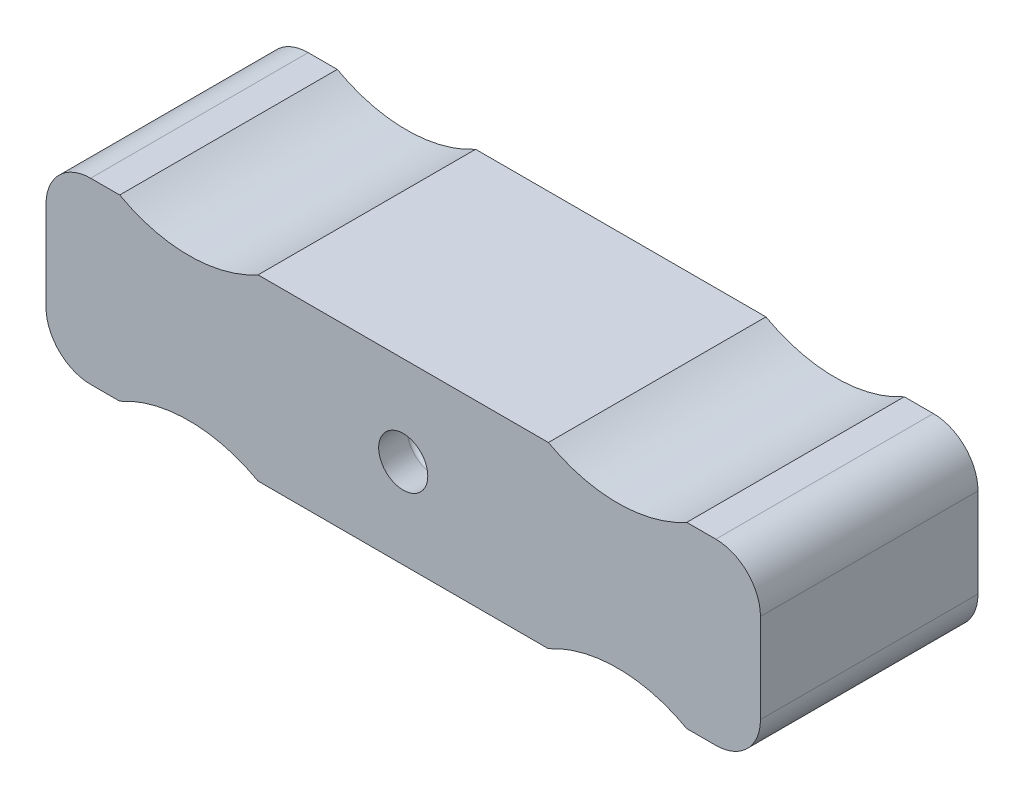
from build123d import *

# Parameters (mm, degrees)
ESQUISSE2_R                     = 2.5
EXTRUSION1_DEPTH                = 24.36
TROU_TARAUD_M6X1_01_D           = 5
TROU_TARAUD_M6X1_01_DEPTH       = 18
TROU_TARAUD_M6X1_01_CBORE_D     = 6
TROU_TARAUD_M6X1_01_CBORE_DEPTH = 15
TROU_TARAUD_M6X1_01_TIP         = 1.502151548


with BuildPart() as part:
    # Esquisse2 → Extrusion1 (new body)
    with BuildSketch(Plane.XY.offset(-20)):
        with BuildLine():
            Line((63, 95), (66.254033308, 95))
            ThreePointArc((66.254033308, 95), (74, 97), (81.745966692, 95))
            Line((81.745966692, 95), (114.254033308, 95))
            ThreePointArc((114.254033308, 95), (122, 97), (129.745966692, 95))
            Line((129.745966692, 95), (133, 95))
            ThreePointArc((133, 95), (136.535533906, 96.464466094), (138, 100))
            Line((138, 100), (138, 110))
            ThreePointArc((138, 110), (136.535533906, 113.535533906), (133, 115))
            Line((133, 115), (129.745966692, 115))
            ThreePointArc((129.745966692, 115), (122, 113), (114.254033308, 115))
            Line((114.254033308, 115), (81.745966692, 115))
            ThreePointArc((81.745966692, 115), (74, 113), (66.254033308, 115))
            Line((66.254033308, 115), (63, 115))
            ThreePointArc((63, 115), (59.464466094, 113.535533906), (58, 110))
            Line((58, 110), (58, 100))
            ThreePointArc((58, 100), (59.464466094, 96.464466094), (63, 95))
        make_face()
        with Locations((98, 105)):
            Circle(ESQUISSE2_R, mode=Mode.SUBTRACT)
    extrude(amount=EXTRUSION1_DEPTH)

    # Trou taraud_ M6x1.01
    with Locations(Plane(origin=(0, 0, -20), x_dir=(-1, 0, 0), z_dir=(0, 0, -1))):
        with Locations((-85.5, 105), (-110.5, 105)):
            CounterBoreHole(TROU_TARAUD_M6X1_01_D / 2, TROU_TARAUD_M6X1_01_CBORE_D / 2, TROU_TARAUD_M6X1_01_CBORE_DEPTH, depth=TROU_TARAUD_M6X1_01_DEPTH)
            with Locations((0, 0, -(TROU_TARAUD_M6X1_01_DEPTH + TROU_TARAUD_M6X1_01_TIP / 2))):  # 118° drill point
                Cone(0, TROU_TARAUD_M6X1_01_D / 2, TROU_TARAUD_M6X1_01_TIP, mode=Mode.SUBTRACT)

    # Esquisse7 → Enl_vement de mati_re-R_volution1 (revolve, cut)
    with BuildSketch(Plane(origin=(0, 105, 0), x_dir=(-1, 0, 0), z_dir=(0, 1, 0))):
        with BuildLine():
            Line((-98, 4.36), (-100.75, 4.36))
            Line((-100.75, 4.36), (-101.052397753, 0.903577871))
            ThreePointArc((-101.052397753, 0.903577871), (-100.922939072, 0.522204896), (-100.554300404, 0.36))
            Line((-100.554300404, 0.36), (-98, 0.36))
            Line((-98, 0.36), (-98, 4.36))
        make_face()
    revolve(axis=Axis((98, 105, 4.36), (0, 0, -1)), mode=Mode.SUBTRACT)


solid = part.part
